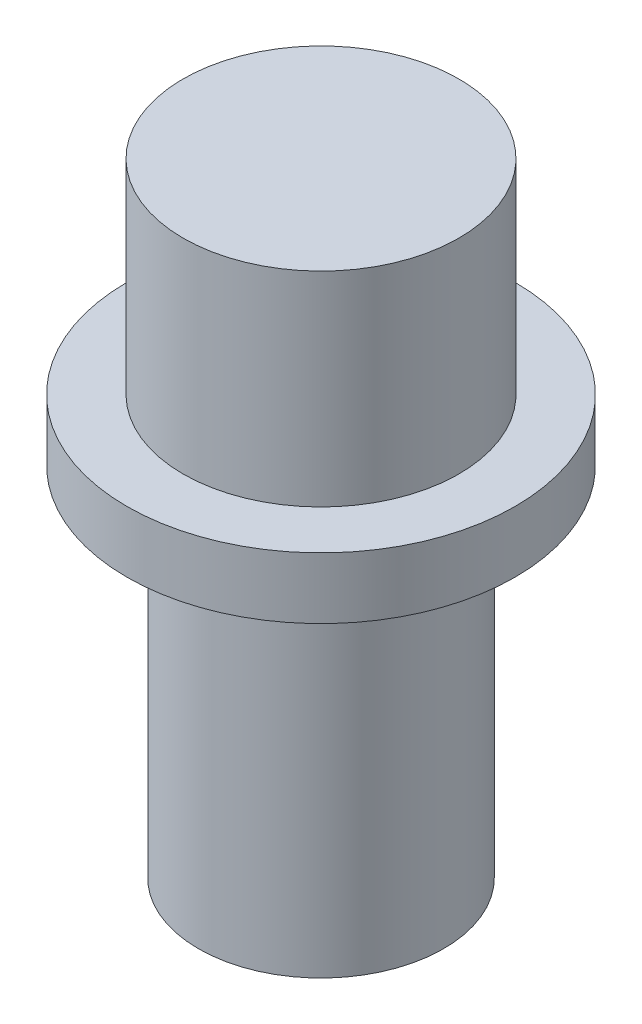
ISO-10303-21;
HEADER;
FILE_DESCRIPTION(('STEP AP214'),'2;1');
FILE_NAME('part.step','',(''),(''),'','','');
FILE_SCHEMA(('AUTOMOTIVE_DESIGN { 1 0 10303 214 1 1 1 1 }'));
ENDSEC;
DATA;
#1=APPLICATION_CONTEXT('core data for automotive mechanical design processes');
#2=APPLICATION_PROTOCOL_DEFINITION('international standard','automotive_design',2000,#1);
#3=PRODUCT_CONTEXT('',#1,'mechanical');
#4=PRODUCT('Part','Part','',(#3));
#5=PRODUCT_RELATED_PRODUCT_CATEGORY('part','',(#4));
#6=PRODUCT_DEFINITION_FORMATION('','',#4);
#7=PRODUCT_DEFINITION_CONTEXT('part definition',#1,'design');
#8=PRODUCT_DEFINITION('design','',#6,#7);
#9=PRODUCT_DEFINITION_SHAPE('','',#8);
#10=(LENGTH_UNIT() NAMED_UNIT(*) SI_UNIT(.MILLI.,.METRE.));
#11=(NAMED_UNIT(*) PLANE_ANGLE_UNIT() SI_UNIT($,.RADIAN.));
#12=(NAMED_UNIT(*) SI_UNIT($,.STERADIAN.) SOLID_ANGLE_UNIT());
#13=UNCERTAINTY_MEASURE_WITH_UNIT(LENGTH_MEASURE(1.E-05),#10,'distance_accuracy_value','');
#14=(GEOMETRIC_REPRESENTATION_CONTEXT(3) GLOBAL_UNCERTAINTY_ASSIGNED_CONTEXT((#13)) GLOBAL_UNIT_ASSIGNED_CONTEXT((#10,
#11,#12)) REPRESENTATION_CONTEXT('',''));
#15=CARTESIAN_POINT('',(0.,0.,0.));
#16=DIRECTION('',(0.,0.,1.));
#17=DIRECTION('',(1.,0.,0.));
#18=AXIS2_PLACEMENT_3D('',#15,#16,#17);
#19=CARTESIAN_POINT('',(0.,35.,0.));
#20=DIRECTION('',(0.,-1.,0.));
#21=DIRECTION('',(0.,0.,-1.));
#22=AXIS2_PLACEMENT_3D('',#19,#20,#21);
#23=CYLINDRICAL_SURFACE('',#22,12.);
#24=CARTESIAN_POINT('',(0.,35.,0.));
#25=DIRECTION('',(0.,1.,0.));
#26=DIRECTION('',(0.,0.,1.));
#27=AXIS2_PLACEMENT_3D('',#24,#25,#26);
#28=CIRCLE('',#27,12.);
#29=CARTESIAN_POINT('',(0.,35.,12.));
#30=VERTEX_POINT('',#29);
#31=EDGE_CURVE('E49',#30,#30,#28,.T.);
#32=ORIENTED_EDGE('',*,*,#31,.F.);
#33=EDGE_LOOP('',(#32));
#34=FACE_BOUND('',#33,.T.);
#35=CARTESIAN_POINT('',(0.,0.,0.));
#36=DIRECTION('',(0.,1.,0.));
#37=DIRECTION('',(0.,0.,1.));
#38=AXIS2_PLACEMENT_3D('',#35,#36,#37);
#39=CIRCLE('',#38,12.);
#40=CARTESIAN_POINT('',(0.,0.,12.));
#41=VERTEX_POINT('',#40);
#42=EDGE_CURVE('E44',#41,#41,#39,.T.);
#43=ORIENTED_EDGE('',*,*,#42,.T.);
#44=EDGE_LOOP('',(#43));
#45=FACE_BOUND('',#44,.T.);
#46=ADVANCED_FACE('F41',(#34,#45),#23,.T.);
#47=CARTESIAN_POINT('',(0.,0.,0.));
#48=DIRECTION('',(0.,1.,0.));
#49=DIRECTION('',(0.,0.,1.));
#50=AXIS2_PLACEMENT_3D('',#47,#48,#49);
#51=PLANE('',#50);
#52=ORIENTED_EDGE('',*,*,#42,.F.);
#53=EDGE_LOOP('',(#52));
#54=FACE_BOUND('',#53,.T.);
#55=ADVANCED_FACE('F87',(#54),#51,.F.);
#56=CARTESIAN_POINT('',(0.,41.,0.));
#57=DIRECTION('',(0.,-1.,0.));
#58=DIRECTION('',(0.,0.,-1.));
#59=AXIS2_PLACEMENT_3D('',#56,#57,#58);
#60=CYLINDRICAL_SURFACE('',#59,19.);
#61=CARTESIAN_POINT('',(0.,41.,0.));
#62=DIRECTION('',(0.,1.,0.));
#63=DIRECTION('',(0.,0.,1.));
#64=AXIS2_PLACEMENT_3D('',#61,#62,#63);
#65=CIRCLE('',#64,19.);
#66=CARTESIAN_POINT('',(0.,41.,19.));
#67=VERTEX_POINT('',#66);
#68=EDGE_CURVE('E58',#67,#67,#65,.T.);
#69=ORIENTED_EDGE('',*,*,#68,.F.);
#70=EDGE_LOOP('',(#69));
#71=FACE_BOUND('',#70,.T.);
#72=CARTESIAN_POINT('',(0.,35.,0.));
#73=DIRECTION('',(0.,1.,0.));
#74=DIRECTION('',(0.,0.,1.));
#75=AXIS2_PLACEMENT_3D('',#72,#73,#74);
#76=CIRCLE('',#75,19.);
#77=CARTESIAN_POINT('',(0.,35.,19.));
#78=VERTEX_POINT('',#77);
#79=EDGE_CURVE('E62',#78,#78,#76,.T.);
#80=ORIENTED_EDGE('',*,*,#79,.T.);
#81=EDGE_LOOP('',(#80));
#82=FACE_BOUND('',#81,.T.);
#83=ADVANCED_FACE('F92',(#71,#82),#60,.T.);
#84=CARTESIAN_POINT('',(0.,41.,0.));
#85=DIRECTION('',(0.,1.,0.));
#86=DIRECTION('',(0.,0.,1.));
#87=AXIS2_PLACEMENT_3D('',#84,#85,#86);
#88=PLANE('',#87);
#89=CARTESIAN_POINT('',(0.,41.,0.));
#90=DIRECTION('',(0.,1.,0.));
#91=DIRECTION('',(0.,0.,1.));
#92=AXIS2_PLACEMENT_3D('',#89,#90,#91);
#93=CIRCLE('',#92,13.5);
#94=CARTESIAN_POINT('',(0.,41.,13.5));
#95=VERTEX_POINT('',#94);
#96=EDGE_CURVE('E10',#95,#95,#93,.T.);
#97=ORIENTED_EDGE('',*,*,#96,.F.);
#98=EDGE_LOOP('',(#97));
#99=FACE_BOUND('',#98,.T.);
#100=ORIENTED_EDGE('',*,*,#68,.T.);
#101=EDGE_LOOP('',(#100));
#102=FACE_BOUND('',#101,.T.);
#103=ADVANCED_FACE('F82',(#99,#102),#88,.T.);
#104=CARTESIAN_POINT('',(0.,35.,0.));
#105=DIRECTION('',(0.,1.,0.));
#106=DIRECTION('',(0.,0.,1.));
#107=AXIS2_PLACEMENT_3D('',#104,#105,#106);
#108=PLANE('',#107);
#109=ORIENTED_EDGE('',*,*,#31,.T.);
#110=EDGE_LOOP('',(#109));
#111=FACE_BOUND('',#110,.T.);
#112=ORIENTED_EDGE('',*,*,#79,.F.);
#113=EDGE_LOOP('',(#112));
#114=FACE_BOUND('',#113,.T.);
#115=ADVANCED_FACE('F75',(#111,#114),#108,.F.);
#116=CARTESIAN_POINT('',(0.,61.,0.));
#117=DIRECTION('',(0.,-1.,0.));
#118=DIRECTION('',(0.,0.,-1.));
#119=AXIS2_PLACEMENT_3D('',#116,#117,#118);
#120=CYLINDRICAL_SURFACE('',#119,13.5);
#121=CARTESIAN_POINT('',(0.,61.,0.));
#122=DIRECTION('',(0.,1.,0.));
#123=DIRECTION('',(0.,0.,1.));
#124=AXIS2_PLACEMENT_3D('',#121,#122,#123);
#125=CIRCLE('',#124,13.5);
#126=CARTESIAN_POINT('',(0.,61.,13.5));
#127=VERTEX_POINT('',#126);
#128=EDGE_CURVE('E57',#127,#127,#125,.T.);
#129=ORIENTED_EDGE('',*,*,#128,.F.);
#130=EDGE_LOOP('',(#129));
#131=FACE_BOUND('',#130,.T.);
#132=ORIENTED_EDGE('',*,*,#96,.T.);
#133=EDGE_LOOP('',(#132));
#134=FACE_BOUND('',#133,.T.);
#135=ADVANCED_FACE('F73',(#131,#134),#120,.T.);
#136=CARTESIAN_POINT('',(0.,61.,0.));
#137=DIRECTION('',(0.,1.,0.));
#138=DIRECTION('',(0.,0.,1.));
#139=AXIS2_PLACEMENT_3D('',#136,#137,#138);
#140=PLANE('',#139);
#141=ORIENTED_EDGE('',*,*,#128,.T.);
#142=EDGE_LOOP('',(#141));
#143=FACE_BOUND('',#142,.T.);
#144=ADVANCED_FACE('F71',(#143),#140,.T.);
#145=CLOSED_SHELL('',(#46,#55,#83,#103,#115,#135,#144));
#146=MANIFOLD_SOLID_BREP('B2',#145);
#147=ADVANCED_BREP_SHAPE_REPRESENTATION('',(#18,#146),#14);
#148=SHAPE_DEFINITION_REPRESENTATION(#9,#147);
ENDSEC;
END-ISO-10303-21;
